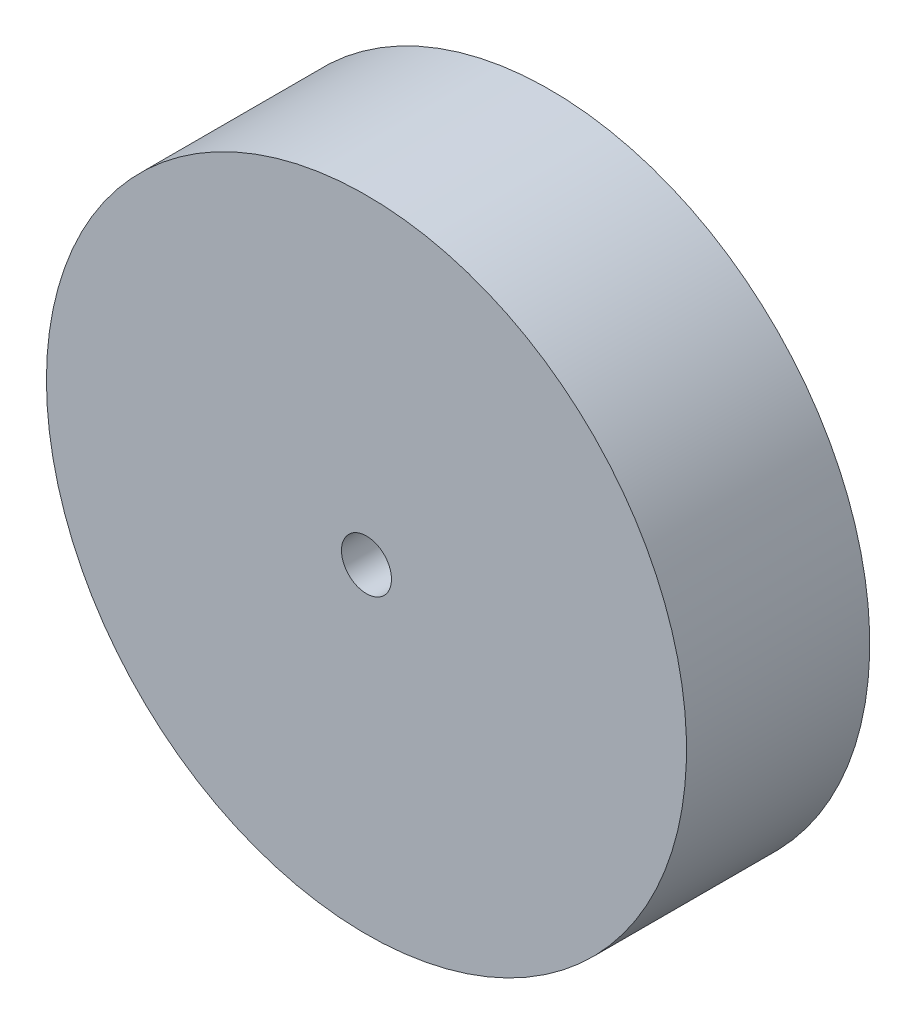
ISO-10303-21;
HEADER;
FILE_DESCRIPTION(('STEP AP214'),'2;1');
FILE_NAME('part.step','',(''),(''),'','','');
FILE_SCHEMA(('AUTOMOTIVE_DESIGN { 1 0 10303 214 1 1 1 1 }'));
ENDSEC;
DATA;
#1=APPLICATION_CONTEXT('core data for automotive mechanical design processes');
#2=APPLICATION_PROTOCOL_DEFINITION('international standard','automotive_design',2000,#1);
#3=PRODUCT_CONTEXT('',#1,'mechanical');
#4=PRODUCT('Part','Part','',(#3));
#5=PRODUCT_RELATED_PRODUCT_CATEGORY('part','',(#4));
#6=PRODUCT_DEFINITION_FORMATION('','',#4);
#7=PRODUCT_DEFINITION_CONTEXT('part definition',#1,'design');
#8=PRODUCT_DEFINITION('design','',#6,#7);
#9=PRODUCT_DEFINITION_SHAPE('','',#8);
#10=(LENGTH_UNIT() NAMED_UNIT(*) SI_UNIT(.MILLI.,.METRE.));
#11=(NAMED_UNIT(*) PLANE_ANGLE_UNIT() SI_UNIT($,.RADIAN.));
#12=(NAMED_UNIT(*) SI_UNIT($,.STERADIAN.) SOLID_ANGLE_UNIT());
#13=UNCERTAINTY_MEASURE_WITH_UNIT(LENGTH_MEASURE(1.E-05),#10,'distance_accuracy_value','');
#14=(GEOMETRIC_REPRESENTATION_CONTEXT(3) GLOBAL_UNCERTAINTY_ASSIGNED_CONTEXT((#13)) GLOBAL_UNIT_ASSIGNED_CONTEXT((#10,
#11,#12)) REPRESENTATION_CONTEXT('',''));
#15=CARTESIAN_POINT('',(0.,0.,0.));
#16=DIRECTION('',(0.,0.,1.));
#17=DIRECTION('',(1.,0.,0.));
#18=AXIS2_PLACEMENT_3D('',#15,#16,#17);
#19=CARTESIAN_POINT('',(0.,0.,29.083));
#20=DIRECTION('',(0.,0.,-1.));
#21=DIRECTION('',(-1.,0.,0.));
#22=AXIS2_PLACEMENT_3D('',#19,#20,#21);
#23=CYLINDRICAL_SURFACE('',#22,50.8);
#24=CARTESIAN_POINT('',(0.,0.,29.083));
#25=DIRECTION('',(0.,0.,1.));
#26=DIRECTION('',(1.,0.,0.));
#27=AXIS2_PLACEMENT_3D('',#24,#25,#26);
#28=CIRCLE('',#27,50.8);
#29=CARTESIAN_POINT('',(-50.8,0.,29.083));
#30=VERTEX_POINT('',#29);
#31=EDGE_CURVE('E10',#30,#30,#28,.T.);
#32=CARTESIAN_POINT('',(0.,0.,0.));
#33=DIRECTION('',(0.,0.,1.));
#34=DIRECTION('',(1.,0.,0.));
#35=AXIS2_PLACEMENT_3D('',#32,#33,#34);
#36=CIRCLE('',#35,50.8);
#37=CARTESIAN_POINT('',(-50.8,0.,0.));
#38=VERTEX_POINT('',#37);
#39=EDGE_CURVE('E32',#38,#38,#36,.T.);
#40=CARTESIAN_POINT('',(-50.8,0.,29.083));
#41=CARTESIAN_POINT('',(-50.8,0.,28.7800520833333));
#42=CARTESIAN_POINT('',(-50.8,0.,28.4771041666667));
#43=CARTESIAN_POINT('',(-50.8,0.,27.8712083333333));
#44=CARTESIAN_POINT('',(-50.8,0.,27.5682604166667));
#45=CARTESIAN_POINT('',(-50.8,0.,26.9623645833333));
#46=CARTESIAN_POINT('',(-50.8,0.,26.6594166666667));
#47=CARTESIAN_POINT('',(-50.8,0.,26.0535208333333));
#48=CARTESIAN_POINT('',(-50.8,0.,25.7505729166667));
#49=CARTESIAN_POINT('',(-50.8,0.,25.1446770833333));
#50=CARTESIAN_POINT('',(-50.8,0.,24.8417291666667));
#51=CARTESIAN_POINT('',(-50.8,0.,24.2358333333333));
#52=CARTESIAN_POINT('',(-50.8,0.,23.9328854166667));
#53=CARTESIAN_POINT('',(-50.8,0.,23.3269895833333));
#54=CARTESIAN_POINT('',(-50.8,0.,23.0240416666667));
#55=CARTESIAN_POINT('',(-50.8,0.,22.4181458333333));
#56=CARTESIAN_POINT('',(-50.8,0.,22.1151979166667));
#57=CARTESIAN_POINT('',(-50.8,0.,21.5093020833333));
#58=CARTESIAN_POINT('',(-50.8,0.,21.2063541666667));
#59=CARTESIAN_POINT('',(-50.8,0.,20.6004583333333));
#60=CARTESIAN_POINT('',(-50.8,0.,20.2975104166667));
#61=CARTESIAN_POINT('',(-50.8,0.,19.6916145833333));
#62=CARTESIAN_POINT('',(-50.8,0.,19.3886666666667));
#63=CARTESIAN_POINT('',(-50.8,0.,18.7827708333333));
#64=CARTESIAN_POINT('',(-50.8,0.,18.4798229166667));
#65=CARTESIAN_POINT('',(-50.8,0.,17.8739270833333));
#66=CARTESIAN_POINT('',(-50.8,0.,17.5709791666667));
#67=CARTESIAN_POINT('',(-50.8,0.,16.9650833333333));
#68=CARTESIAN_POINT('',(-50.8,0.,16.6621354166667));
#69=CARTESIAN_POINT('',(-50.8,0.,16.0562395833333));
#70=CARTESIAN_POINT('',(-50.8,0.,15.7532916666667));
#71=CARTESIAN_POINT('',(-50.8,0.,15.1473958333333));
#72=CARTESIAN_POINT('',(-50.8,0.,14.8444479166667));
#73=CARTESIAN_POINT('',(-50.8,0.,14.2385520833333));
#74=CARTESIAN_POINT('',(-50.8,0.,13.9356041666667));
#75=CARTESIAN_POINT('',(-50.8,0.,13.3297083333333));
#76=CARTESIAN_POINT('',(-50.8,0.,13.0267604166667));
#77=CARTESIAN_POINT('',(-50.8,0.,12.4208645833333));
#78=CARTESIAN_POINT('',(-50.8,0.,12.1179166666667));
#79=CARTESIAN_POINT('',(-50.8,0.,11.5120208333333));
#80=CARTESIAN_POINT('',(-50.8,0.,11.2090729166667));
#81=CARTESIAN_POINT('',(-50.8,0.,10.6031770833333));
#82=CARTESIAN_POINT('',(-50.8,0.,10.3002291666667));
#83=CARTESIAN_POINT('',(-50.8,0.,9.69433333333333));
#84=CARTESIAN_POINT('',(-50.8,0.,9.39138541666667));
#85=CARTESIAN_POINT('',(-50.8,0.,8.78548958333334));
#86=CARTESIAN_POINT('',(-50.8,0.,8.48254166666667));
#87=CARTESIAN_POINT('',(-50.8,0.,7.87664583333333));
#88=CARTESIAN_POINT('',(-50.8,0.,7.57369791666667));
#89=CARTESIAN_POINT('',(-50.8,0.,6.96780208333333));
#90=CARTESIAN_POINT('',(-50.8,0.,6.66485416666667));
#91=CARTESIAN_POINT('',(-50.8,0.,6.05895833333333));
#92=CARTESIAN_POINT('',(-50.8,0.,5.75601041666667));
#93=CARTESIAN_POINT('',(-50.8,0.,5.15011458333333));
#94=CARTESIAN_POINT('',(-50.8,0.,4.84716666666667));
#95=CARTESIAN_POINT('',(-50.8,0.,4.24127083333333));
#96=CARTESIAN_POINT('',(-50.8,0.,3.93832291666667));
#97=CARTESIAN_POINT('',(-50.8,0.,3.33242708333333));
#98=CARTESIAN_POINT('',(-50.8,0.,3.02947916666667));
#99=CARTESIAN_POINT('',(-50.8,0.,2.42358333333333));
#100=CARTESIAN_POINT('',(-50.8,0.,2.12063541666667));
#101=CARTESIAN_POINT('',(-50.8,0.,1.51473958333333));
#102=CARTESIAN_POINT('',(-50.8,0.,1.21179166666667));
#103=CARTESIAN_POINT('',(-50.8,0.,0.605895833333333));
#104=CARTESIAN_POINT('',(-50.8,0.,0.302947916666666));
#105=CARTESIAN_POINT('',(-50.8,0.,0.));
#106=B_SPLINE_CURVE_WITH_KNOTS('',3,(#40,#41,#42,#43,#44,#45,#46,#47,#48,#49,#50,#51,#52,#53,
#54,#55,#56,#57,#58,#59,#60,#61,#62,#63,#64,#65,#66,#67,#68,#69,#70,#71,#72,#73,#74,#75,#76,#77,
#78,#79,#80,#81,#82,#83,#84,#85,#86,#87,#88,#89,#90,#91,#92,#93,#94,#95,#96,#97,#98,#99,#100,
#101,#102,#103,#104,#105),.UNSPECIFIED.,.F.,.F.,(4,2,2,2,2,2,2,2,2,2,2,2,2,2,2,2,2,2,2,2,2,2,2,
2,2,2,2,2,2,2,2,2,4),(0.,0.908843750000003,1.8176875,2.72653125,3.635375,4.54421875,5.4530625,
6.36190625,7.27075,8.17959375,9.0884375,9.99728125,10.906125,11.81496875,12.7238125,13.63265625,
14.5415,15.45034375,16.3591875,17.26803125,18.176875,19.08571875,19.9945625,20.90340625,
21.81225,22.72109375,23.6299375,24.53878125,25.447625,26.35646875,27.2653125,28.17415625,
29.083),.UNSPECIFIED.);
#107=EDGE_CURVE('BSEAM29',#30,#38,#106,.T.);
#108=ORIENTED_EDGE('',*,*,#31,.F.);
#109=ORIENTED_EDGE('',*,*,#39,.T.);
#110=ORIENTED_EDGE('',*,*,#107,.T.);
#111=ORIENTED_EDGE('',*,*,#107,.F.);
#112=EDGE_LOOP('',(#108,#110,#109,#111));
#113=FACE_BOUND('',#112,.T.);
#114=ADVANCED_FACE('F29',(#113),#23,.T.);
#115=CARTESIAN_POINT('',(0.,0.,29.083));
#116=DIRECTION('',(0.,0.,1.));
#117=DIRECTION('',(1.,0.,0.));
#118=AXIS2_PLACEMENT_3D('',#115,#116,#117);
#119=PLANE('',#118);
#120=CARTESIAN_POINT('',(0.,0.,29.083));
#121=DIRECTION('',(0.,0.,-1.));
#122=DIRECTION('',(-1.,0.,0.));
#123=AXIS2_PLACEMENT_3D('',#120,#121,#122);
#124=CIRCLE('',#123,3.96875);
#125=CARTESIAN_POINT('',(-3.96875,0.,29.083));
#126=VERTEX_POINT('',#125);
#127=EDGE_CURVE('E39',#126,#126,#124,.T.);
#128=ORIENTED_EDGE('',*,*,#127,.T.);
#129=EDGE_LOOP('',(#128));
#130=FACE_BOUND('',#129,.T.);
#131=ORIENTED_EDGE('',*,*,#31,.T.);
#132=EDGE_LOOP('',(#131));
#133=FACE_BOUND('',#132,.T.);
#134=ADVANCED_FACE('F47',(#130,#133),#119,.T.);
#135=CARTESIAN_POINT('',(0.,0.,0.));
#136=DIRECTION('',(0.,0.,1.));
#137=DIRECTION('',(1.,0.,0.));
#138=AXIS2_PLACEMENT_3D('',#135,#136,#137);
#139=PLANE('',#138);
#140=CARTESIAN_POINT('',(0.,0.,0.));
#141=DIRECTION('',(0.,0.,-1.));
#142=DIRECTION('',(-1.,0.,0.));
#143=AXIS2_PLACEMENT_3D('',#140,#141,#142);
#144=CIRCLE('',#143,3.96875);
#145=CARTESIAN_POINT('',(-3.96875,0.,0.));
#146=VERTEX_POINT('',#145);
#147=EDGE_CURVE('E41',#146,#146,#144,.T.);
#148=ORIENTED_EDGE('',*,*,#147,.F.);
#149=EDGE_LOOP('',(#148));
#150=FACE_BOUND('',#149,.T.);
#151=ORIENTED_EDGE('',*,*,#39,.F.);
#152=EDGE_LOOP('',(#151));
#153=FACE_BOUND('',#152,.T.);
#154=ADVANCED_FACE('F52',(#150,#153),#139,.F.);
#155=CARTESIAN_POINT('',(0.,0.,29.083));
#156=DIRECTION('',(0.,0.,-1.));
#157=DIRECTION('',(-1.,0.,0.));
#158=AXIS2_PLACEMENT_3D('',#155,#156,#157);
#159=CYLINDRICAL_SURFACE('',#158,3.96875);
#160=CARTESIAN_POINT('',(-3.96875,0.,29.083));
#161=CARTESIAN_POINT('',(-3.96875,0.,28.7800520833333));
#162=CARTESIAN_POINT('',(-3.96875,0.,28.4771041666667));
#163=CARTESIAN_POINT('',(-3.96875,0.,27.8712083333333));
#164=CARTESIAN_POINT('',(-3.96875,0.,27.5682604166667));
#165=CARTESIAN_POINT('',(-3.96875,0.,26.9623645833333));
#166=CARTESIAN_POINT('',(-3.96875,0.,26.6594166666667));
#167=CARTESIAN_POINT('',(-3.96875,0.,26.0535208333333));
#168=CARTESIAN_POINT('',(-3.96875,0.,25.7505729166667));
#169=CARTESIAN_POINT('',(-3.96875,0.,25.1446770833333));
#170=CARTESIAN_POINT('',(-3.96875,0.,24.8417291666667));
#171=CARTESIAN_POINT('',(-3.96875,0.,24.2358333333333));
#172=CARTESIAN_POINT('',(-3.96875,0.,23.9328854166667));
#173=CARTESIAN_POINT('',(-3.96875,0.,23.3269895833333));
#174=CARTESIAN_POINT('',(-3.96875,0.,23.0240416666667));
#175=CARTESIAN_POINT('',(-3.96875,0.,22.4181458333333));
#176=CARTESIAN_POINT('',(-3.96875,0.,22.1151979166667));
#177=CARTESIAN_POINT('',(-3.96875,0.,21.5093020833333));
#178=CARTESIAN_POINT('',(-3.96875,0.,21.2063541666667));
#179=CARTESIAN_POINT('',(-3.96875,0.,20.6004583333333));
#180=CARTESIAN_POINT('',(-3.96875,0.,20.2975104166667));
#181=CARTESIAN_POINT('',(-3.96875,0.,19.6916145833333));
#182=CARTESIAN_POINT('',(-3.96875,0.,19.3886666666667));
#183=CARTESIAN_POINT('',(-3.96875,0.,18.7827708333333));
#184=CARTESIAN_POINT('',(-3.96875,0.,18.4798229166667));
#185=CARTESIAN_POINT('',(-3.96875,0.,17.8739270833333));
#186=CARTESIAN_POINT('',(-3.96875,0.,17.5709791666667));
#187=CARTESIAN_POINT('',(-3.96875,0.,16.9650833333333));
#188=CARTESIAN_POINT('',(-3.96875,0.,16.6621354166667));
#189=CARTESIAN_POINT('',(-3.96875,0.,16.0562395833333));
#190=CARTESIAN_POINT('',(-3.96875,0.,15.7532916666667));
#191=CARTESIAN_POINT('',(-3.96875,0.,15.1473958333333));
#192=CARTESIAN_POINT('',(-3.96875,0.,14.8444479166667));
#193=CARTESIAN_POINT('',(-3.96875,0.,14.2385520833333));
#194=CARTESIAN_POINT('',(-3.96875,0.,13.9356041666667));
#195=CARTESIAN_POINT('',(-3.96875,0.,13.3297083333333));
#196=CARTESIAN_POINT('',(-3.96875,0.,13.0267604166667));
#197=CARTESIAN_POINT('',(-3.96875,0.,12.4208645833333));
#198=CARTESIAN_POINT('',(-3.96875,0.,12.1179166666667));
#199=CARTESIAN_POINT('',(-3.96875,0.,11.5120208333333));
#200=CARTESIAN_POINT('',(-3.96875,0.,11.2090729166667));
#201=CARTESIAN_POINT('',(-3.96875,0.,10.6031770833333));
#202=CARTESIAN_POINT('',(-3.96875,0.,10.3002291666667));
#203=CARTESIAN_POINT('',(-3.96875,0.,9.69433333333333));
#204=CARTESIAN_POINT('',(-3.96875,0.,9.39138541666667));
#205=CARTESIAN_POINT('',(-3.96875,0.,8.78548958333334));
#206=CARTESIAN_POINT('',(-3.96875,0.,8.48254166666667));
#207=CARTESIAN_POINT('',(-3.96875,0.,7.87664583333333));
#208=CARTESIAN_POINT('',(-3.96875,0.,7.57369791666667));
#209=CARTESIAN_POINT('',(-3.96875,0.,6.96780208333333));
#210=CARTESIAN_POINT('',(-3.96875,0.,6.66485416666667));
#211=CARTESIAN_POINT('',(-3.96875,0.,6.05895833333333));
#212=CARTESIAN_POINT('',(-3.96875,0.,5.75601041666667));
#213=CARTESIAN_POINT('',(-3.96875,0.,5.15011458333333));
#214=CARTESIAN_POINT('',(-3.96875,0.,4.84716666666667));
#215=CARTESIAN_POINT('',(-3.96875,0.,4.24127083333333));
#216=CARTESIAN_POINT('',(-3.96875,0.,3.93832291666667));
#217=CARTESIAN_POINT('',(-3.96875,0.,3.33242708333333));
#218=CARTESIAN_POINT('',(-3.96875,0.,3.02947916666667));
#219=CARTESIAN_POINT('',(-3.96875,0.,2.42358333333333));
#220=CARTESIAN_POINT('',(-3.96875,0.,2.12063541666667));
#221=CARTESIAN_POINT('',(-3.96875,0.,1.51473958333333));
#222=CARTESIAN_POINT('',(-3.96875,0.,1.21179166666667));
#223=CARTESIAN_POINT('',(-3.96875,0.,0.605895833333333));
#224=CARTESIAN_POINT('',(-3.96875,0.,0.302947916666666));
#225=CARTESIAN_POINT('',(-3.96875,0.,0.));
#226=B_SPLINE_CURVE_WITH_KNOTS('',3,(#160,#161,#162,#163,#164,#165,#166,#167,#168,#169,#170,
#171,#172,#173,#174,#175,#176,#177,#178,#179,#180,#181,#182,#183,#184,#185,#186,#187,#188,#189,
#190,#191,#192,#193,#194,#195,#196,#197,#198,#199,#200,#201,#202,#203,#204,#205,#206,#207,#208,
#209,#210,#211,#212,#213,#214,#215,#216,#217,#218,#219,#220,#221,#222,#223,#224,#225),
.UNSPECIFIED.,.F.,.F.,(4,2,2,2,2,2,2,2,2,2,2,2,2,2,2,2,2,2,2,2,2,2,2,2,2,2,2,2,2,2,2,2,4),(0.,
0.908843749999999,1.8176875,2.72653125,3.635375,4.54421875,5.4530625,6.36190625,7.27075,
8.17959375,9.0884375,9.99728125,10.906125,11.81496875,12.7238125,13.63265625,14.5415,
15.45034375,16.3591875,17.26803125,18.176875,19.08571875,19.9945625,20.90340625,21.81225,
22.72109375,23.6299375,24.53878125,25.447625,26.35646875,27.2653125,28.17415625,29.083),.UNSPECIFIED.);
#227=EDGE_CURVE('BSEAM49',#126,#146,#226,.T.);
#228=ORIENTED_EDGE('',*,*,#127,.F.);
#229=ORIENTED_EDGE('',*,*,#147,.T.);
#230=ORIENTED_EDGE('',*,*,#227,.T.);
#231=ORIENTED_EDGE('',*,*,#227,.F.);
#232=EDGE_LOOP('',(#228,#230,#229,#231));
#233=FACE_BOUND('',#232,.T.);
#234=ADVANCED_FACE('F49',(#233),#159,.F.);
#235=CLOSED_SHELL('',(#114,#134,#154,#234));
#236=MANIFOLD_SOLID_BREP('B2',#235);
#237=ADVANCED_BREP_SHAPE_REPRESENTATION('',(#18,#236),#14);
#238=SHAPE_DEFINITION_REPRESENTATION(#9,#237);
ENDSEC;
END-ISO-10303-21;
